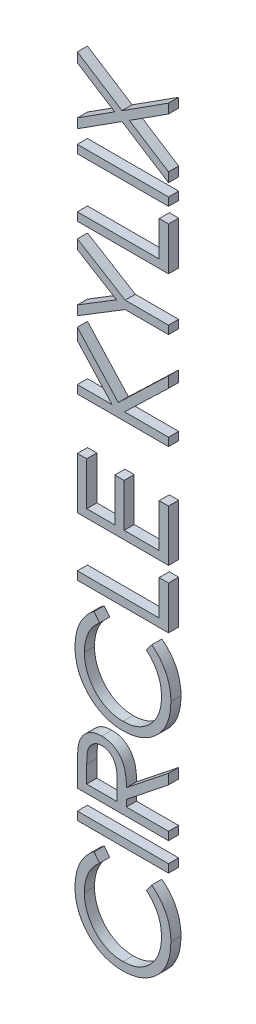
from build123d import *

# Parameters (mm, degrees)
ESTRUSIONE_ESTRUSIONE1_DEPTH    = 10
SCHIZZO2_W                      = 90
SCHIZZO2_H                      = 8.076923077
ESTRUSIONE_ESTRUSIONE1_2_DEPTH  = 10
ESTRUSIONE_ESTRUSIONE1_3_DEPTH  = 10
ESTRUSIONE_ESTRUSIONE1_4_DEPTH  = 10
ESTRUSIONE_ESTRUSIONE1_5_DEPTH  = 10
ESTRUSIONE_ESTRUSIONE1_6_DEPTH  = 10
ESTRUSIONE_ESTRUSIONE1_7_DEPTH  = 10
ESTRUSIONE_ESTRUSIONE1_8_DEPTH  = 10
ESTRUSIONE_ESTRUSIONE1_9_DEPTH  = 10
ESTRUSIONE_ESTRUSIONE1_10_DEPTH = 10
ESTRUSIONE_ESTRUSIONE1_11_DEPTH = 10


with BuildPart() as part:
    # Schizzo2 → Estrusione-Estrusione1 (new body)
    with BuildSketch(Plane.XY):
        with BuildLine():
            Line((121.514423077, 94.615384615), (126.923076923, 87.548076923))
            add(Edge.make_bspline(
                [(126.923076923, 87.548076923), (126.322245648, 87.043920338), (125.128683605, 86.042404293), (123.452521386, 84.431243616), (121.882708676, 82.751774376), (120.409159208, 81.006333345), (119.091097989, 79.154526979), (117.82587331, 77.266914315), (116.718125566, 75.274910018), (115.364873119, 72.53433639), (113.983544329, 68.935219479), (112.795482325, 64.420180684), (112.046317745, 59.700431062), (111.96462775, 56.481187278), (111.923076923, 54.84375)],
                knots=[0, 0, 0, 0, 0.75789156, 1.505565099, 2.245254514, 2.979266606, 3.711207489, 4.440978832, 5.174393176, 5.91211879, 7.394186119, 8.890401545, 10.418332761, 12, 12, 12, 12], degree=3))
            add(Edge.make_bspline(
                [(111.923076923, 54.84375), (111.93346453, 53.941608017), (111.954143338, 52.145696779), (112.226949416, 49.480450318), (112.610380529, 46.864971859), (113.179317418, 44.300962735), (113.898613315, 41.791686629), (114.758124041, 39.320739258), (115.821533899, 36.923894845), (116.996890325, 34.567998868), (118.324448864, 32.31081333), (119.772522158, 30.175133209), (121.324813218, 28.16862281), (122.987480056, 26.29015247), (124.751784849, 24.536116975), (126.637493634, 22.928588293), (128.6244476, 21.446088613), (130.714296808, 20.097066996), (132.887577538, 18.882634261), (135.156697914, 17.861485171), (137.482806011, 16.969620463), (139.882392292, 16.252792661), (142.339507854, 15.68981863), (144.864331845, 15.300604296), (147.452077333, 15.030959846), (149.206028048, 15.010375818), (150.090144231, 15)],
                knots=[0, 0, 0, 0, 1.054877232, 2.099964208, 3.13098259, 4.145888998, 5.169474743, 6.183358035, 7.203388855, 8.234598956, 9.261847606, 10.264062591, 11.251197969, 12.227332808, 13.196685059, 14.158975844, 15.123498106, 16.094582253, 17.066912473, 18.032714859, 19.002806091, 19.979168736, 20.95977404, 21.949109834, 22.966205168, 24, 24, 24, 24], degree=3))
            add(Edge.make_bspline(
                [(150.090144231, 15), (151.420348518, 15.032522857), (154.032028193, 15.096377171), (157.857979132, 15.662254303), (161.526761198, 16.529067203), (165.013533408, 17.806913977), (168.347362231, 19.414009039), (171.487818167, 21.419220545), (174.480909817, 23.750396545), (177.254146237, 26.431451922), (179.787320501, 29.373393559), (182.018059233, 32.529747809), (183.87758227, 35.892777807), (185.424964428, 39.425318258), (186.614422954, 43.154561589), (187.451786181, 47.073799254), (187.998013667, 51.174507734), (188.050308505, 53.976578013), (188.076923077, 55.402644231)],
                knots=[0, 0, 0, 0, 1.029159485, 2.020618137, 2.987588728, 3.942669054, 4.889339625, 5.846988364, 6.821327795, 7.821533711, 8.827683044, 9.822769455, 10.807800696, 11.797391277, 12.803701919, 13.832062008, 14.896664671, 16, 16, 16, 16], degree=3))
            add(Edge.make_bspline(
                [(188.076923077, 55.402644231), (188.033497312, 56.973856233), (187.948025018, 60.06637732), (187.223930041, 64.60155514), (186.049869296, 68.943046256), (184.406779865, 73.091084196), (182.270815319, 77.033975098), (179.681441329, 80.777889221), (176.614027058, 84.325986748), (174.271889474, 86.459534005), (173.076923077, 87.548076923)],
                knots=[0, 0, 0, 0, 1.028121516, 2.023589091, 2.998037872, 3.967518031, 4.937445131, 5.927275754, 6.942489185, 8, 8, 8, 8], degree=3))
            Line((173.076923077, 87.548076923), (178.431490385, 94.615384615))
            add(Edge.make_bspline(
                [(178.431490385, 94.615384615), (179.165310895, 94.046613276), (180.629436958, 92.911794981), (182.693943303, 91.074598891), (184.63406854, 89.137792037), (186.44012376, 87.096396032), (188.119584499, 84.946812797), (189.673363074, 82.68923958), (191.093213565, 80.325603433), (192.397415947, 77.874678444), (193.54572193, 75.330816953), (194.563288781, 72.716413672), (195.40572173, 70.015438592), (196.118325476, 67.250627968), (196.626444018, 64.397011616), (197.031069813, 61.487760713), (197.271123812, 58.495645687), (197.295393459, 56.478789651), (197.307692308, 55.456730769)],
                knots=[0, 0, 0, 0, 0.986911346, 1.969095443, 2.935967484, 3.900112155, 4.865124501, 5.834589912, 6.812044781, 7.795288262, 8.784678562, 9.777857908, 10.776141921, 11.791195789, 12.811324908, 13.855933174, 14.913475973, 16, 16, 16, 16], degree=3))
            add(Edge.make_bspline(
                [(197.307692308, 55.456730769), (197.300955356, 54.488750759), (197.287633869, 52.574690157), (197.071835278, 49.748722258), (196.777413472, 46.997561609), (196.334095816, 44.329071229), (195.810955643, 41.728689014), (195.109694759, 39.21998827), (194.324144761, 36.778282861), (193.400873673, 34.413382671), (192.359028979, 32.123276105), (191.18153175, 29.915349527), (189.878283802, 27.790618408), (188.478012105, 25.728193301), (186.935738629, 23.758541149), (185.272882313, 21.864593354), (183.495047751, 20.03572968), (182.213065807, 18.904232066), (181.568509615, 18.335336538)],
                knots=[0, 0, 0, 0, 1.114604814, 2.203992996, 3.262667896, 4.300477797, 5.318619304, 6.316056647, 7.298880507, 8.271930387, 9.238335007, 10.195173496, 11.151986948, 12.108099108, 13.064862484, 14.031167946, 15.010108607, 16, 16, 16, 16], degree=3))
            add(Edge.make_bspline(
                [(181.568509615, 18.335336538), (180.448855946, 17.42419371), (178.223066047, 15.612908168), (174.616052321, 13.294515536), (170.853377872, 11.316600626), (166.913248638, 9.699531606), (162.794132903, 8.457433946), (158.502657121, 7.584158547), (154.047400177, 7.020635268), (151.017354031, 6.955954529), (149.477163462, 6.923076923)],
                knots=[0, 0, 0, 0, 0.994611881, 1.977215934, 2.950189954, 3.921972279, 4.908960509, 5.911694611, 6.938501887, 8, 8, 8, 8], degree=3))
            add(Edge.make_bspline(
                [(149.477163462, 6.923076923), (147.858308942, 6.963067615), (144.673313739, 7.041746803), (139.999126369, 7.710210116), (135.520947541, 8.785550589), (131.247136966, 10.312899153), (127.155215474, 12.249322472), (123.276441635, 14.641435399), (119.586009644, 17.461447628), (116.139916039, 20.687242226), (112.988904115, 24.22468799), (110.21674459, 28.012886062), (107.90972275, 32.044421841), (105.981250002, 36.274880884), (104.498963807, 40.735941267), (103.461310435, 45.418085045), (102.81544173, 50.312514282), (102.733793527, 53.651833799), (102.692307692, 55.348557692)],
                knots=[0, 0, 0, 0, 1.032925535, 2.032216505, 3.007276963, 3.968222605, 4.92396291, 5.891752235, 6.871517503, 7.883894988, 8.900124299, 9.891468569, 10.874487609, 11.85992873, 12.854644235, 13.869047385, 14.917252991, 16, 16, 16, 16], degree=3))
            add(Edge.make_bspline(
                [(102.692307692, 55.348557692), (102.704716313, 56.382640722), (102.729277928, 58.429503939), (102.968422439, 61.457478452), (103.367918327, 64.405243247), (103.908809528, 67.275898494), (104.589952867, 70.07774346), (105.438875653, 72.805536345), (106.449577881, 75.45259748), (107.603752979, 78.018066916), (108.901616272, 80.484626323), (110.327859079, 82.850727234), (111.875274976, 85.106936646), (113.559705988, 87.241527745), (115.367179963, 89.257112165), (117.276524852, 91.183589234), (119.336735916, 92.964881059), (120.787198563, 94.064209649), (121.514423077, 94.615384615)],
                knots=[0, 0, 0, 0, 1.096622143, 2.170653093, 3.219033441, 4.250379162, 5.267604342, 6.275621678, 7.278284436, 8.271072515, 9.257558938, 10.232633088, 11.19973724, 12.157384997, 13.114417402, 14.069920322, 15.032307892, 16, 16, 16, 16], degree=3))
        make_face()
    extrude(amount=ESTRUSIONE_ESTRUSIONE1_DEPTH)


with BuildPart() as body_2:
    # Schizzo2 → Estrusione-Estrusione1 2 (new body)
    with BuildSketch(Plane.XY):
        with Locations((150, 117.115384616)):
            Rectangle(SCHIZZO2_W, SCHIZZO2_H)
    extrude(amount=ESTRUSIONE_ESTRUSIONE1_2_DEPTH)


with BuildPart() as body_3:
    # Schizzo2 → Estrusione-Estrusione1 3 (new body)
    with BuildSketch(Plane.XY):
        with BuildLine():
            Line((105, 140.769230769), (105, 158.780048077))
            add(Edge.make_bspline(
                [(105, 158.780048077), (105.004000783, 159.98196281), (105.011682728, 162.289772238), (105.054516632, 165.595942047), (105.177285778, 168.600067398), (105.282935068, 171.300577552), (105.475584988, 173.697422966), (105.659715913, 175.7979533), (105.900752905, 177.592494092), (106.124606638, 178.678815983), (106.225961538, 179.170673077)],
                knots=[0, 0, 0, 0, 1.410062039, 2.707475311, 3.878576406, 4.937260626, 5.877586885, 6.699081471, 7.410979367, 8, 8, 8, 8], degree=3))
            add(Edge.make_bspline(
                [(106.225961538, 179.170673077), (106.388650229, 179.829128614), (106.710557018, 181.131993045), (107.390940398, 183.007859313), (108.178325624, 184.795343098), (109.103021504, 186.487181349), (110.17240477, 188.074302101), (111.366110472, 189.575305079), (112.681727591, 190.985317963), (114.13111598, 192.285938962), (115.683394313, 193.467359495), (117.334302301, 194.503647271), (119.07701379, 195.379291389), (120.914243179, 196.066447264), (122.825695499, 196.643046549), (124.83088, 197.030450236), (126.923102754, 197.271764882), (128.346679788, 197.295604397), (129.068509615, 197.307692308)],
                knots=[0, 0, 0, 0, 1.02737844, 2.032840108, 3.019645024, 3.985760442, 4.950801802, 5.916702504, 6.889791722, 7.870143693, 8.864820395, 9.842884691, 10.820524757, 11.815201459, 12.812418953, 13.84314332, 14.906358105, 16, 16, 16, 16], degree=3))
            add(Edge.make_bspline(
                [(129.068509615, 197.307692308), (130.26769802, 197.269918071), (132.607625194, 197.19621075), (136.00347643, 196.508993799), (139.171201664, 195.383311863), (142.106812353, 193.832141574), (144.753086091, 191.856783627), (147.077412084, 189.48271757), (149.022438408, 186.708618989), (150.371224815, 184.126150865), (151.235042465, 181.844928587), (151.84283455, 179.966929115), (152.312427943, 177.918349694), (152.733117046, 175.718818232), (153.050732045, 173.359181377), (153.28335876, 170.84509465), (153.428748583, 168.174765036), (153.450400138, 166.340331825), (153.461538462, 165.396634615)],
                knots=[0, 0, 0, 0, 1.260483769, 2.459530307, 3.627416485, 4.787058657, 5.939039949, 7.08810263, 8.267026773, 9.491475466, 10.141966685, 10.831826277, 11.566392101, 12.351337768, 13.187381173, 14.07005841, 15.007169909, 16, 16, 16, 16], degree=3))
            Line((153.461538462, 165.396634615), (195, 198.461538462))
            Line((195, 198.461538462), (195, 188.473557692))
            Line((195, 188.473557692), (153.461538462, 155.408653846))
            Line((153.461538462, 155.408653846), (153.461538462, 148.846153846))
            Line((153.461538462, 148.846153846), (195, 148.846153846))
            Line((195, 148.846153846), (195, 140.769230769))
            Line((195, 140.769230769), (105, 140.769230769))
        make_face()
        with BuildLine():
            Line((114.230769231, 148.846153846), (144.230769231, 148.846153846))
            Line((144.230769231, 148.846153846), (144.356971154, 165.324519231))
            add(Edge.make_bspline(
                [(144.356971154, 165.324519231), (144.357311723, 166.093891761), (144.357971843, 167.585154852), (144.255272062, 169.742599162), (144.138452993, 171.751406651), (143.959725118, 173.603867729), (143.729526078, 175.300896), (143.44112336, 176.84136153), (143.106561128, 178.228697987), (142.583371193, 179.8414934), (141.790671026, 181.663720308), (140.559465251, 183.600786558), (139.080080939, 185.30040678), (137.339573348, 186.684621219), (135.45629109, 187.844367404), (133.410945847, 188.624830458), (131.269886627, 189.14497595), (129.798812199, 189.201841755), (129.050480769, 189.230769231)],
                knots=[0, 0, 0, 0, 1.146477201, 2.22219935, 3.21835465, 4.145220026, 4.995151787, 5.769831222, 6.480173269, 7.120302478, 8.295254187, 9.430763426, 10.528629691, 11.636497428, 12.733230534, 13.811001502, 14.886462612, 16, 16, 16, 16], degree=3))
            add(Edge.make_bspline(
                [(129.050480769, 189.230769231), (128.326770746, 189.199768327), (126.892641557, 189.138335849), (124.792052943, 188.639532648), (122.808902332, 187.786778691), (120.940629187, 186.66497708), (119.271224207, 185.257111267), (117.827347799, 183.638023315), (116.645336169, 181.808024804), (115.859728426, 180.112707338), (115.398375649, 178.58526022), (115.063049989, 177.26537074), (114.83032148, 175.766688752), (114.609885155, 174.0960298), (114.431435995, 172.250205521), (114.308344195, 170.22380598), (114.236256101, 168.029384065), (114.232640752, 166.508469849), (114.230769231, 165.721153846)],
                knots=[0, 0, 0, 0, 1.100823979, 2.181431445, 3.263702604, 4.376021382, 5.48638238, 6.575013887, 7.666064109, 8.791843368, 9.405226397, 10.093019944, 10.863016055, 11.711746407, 12.658404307, 13.684961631, 14.801597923, 16, 16, 16, 16], degree=3))
            Line((114.230769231, 165.721153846), (114.230769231, 148.846153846))
        make_face(mode=Mode.SUBTRACT)
    extrude(amount=ESTRUSIONE_ESTRUSIONE1_3_DEPTH)


with BuildPart() as body_4:
    # Schizzo2 → Estrusione-Estrusione1 4 (new body)
    with BuildSketch(Plane.XY):
        with BuildLine():
            Line((121.514423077, 300), (126.923076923, 292.932692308))
            add(Edge.make_bspline(
                [(126.923076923, 292.932692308), (126.322245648, 292.428535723), (125.128683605, 291.427019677), (123.452521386, 289.815859), (121.882708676, 288.136389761), (120.409159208, 286.390948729), (119.091097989, 284.539142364), (117.82587331, 282.651529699), (116.718125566, 280.659525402), (115.364873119, 277.918951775), (113.983544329, 274.319834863), (112.795482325, 269.804796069), (112.046317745, 265.085046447), (111.96462775, 261.865802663), (111.923076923, 260.228365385)],
                knots=[0, 0, 0, 0, 0.75789156, 1.505565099, 2.245254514, 2.979266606, 3.711207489, 4.440978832, 5.174393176, 5.91211879, 7.394186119, 8.890401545, 10.418332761, 12, 12, 12, 12], degree=3))
            add(Edge.make_bspline(
                [(111.923076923, 260.228365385), (111.93346453, 259.326223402), (111.954143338, 257.530312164), (112.226949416, 254.865065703), (112.610380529, 252.249587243), (113.179317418, 249.68557812), (113.898613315, 247.176302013), (114.758124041, 244.705354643), (115.821533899, 242.30851023), (116.996890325, 239.952614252), (118.324448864, 237.695428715), (119.772522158, 235.559748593), (121.324813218, 233.553238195), (122.987480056, 231.674767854), (124.751784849, 229.92073236), (126.637493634, 228.313203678), (128.6244476, 226.830703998), (130.714296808, 225.481682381), (132.887577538, 224.267249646), (135.156697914, 223.246100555), (137.482806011, 222.354235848), (139.882392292, 221.637408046), (142.339507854, 221.074434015), (144.864331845, 220.68521968), (147.452077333, 220.415575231), (149.206028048, 220.394991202), (150.090144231, 220.384615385)],
                knots=[0, 0, 0, 0, 1.054877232, 2.099964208, 3.13098259, 4.145888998, 5.169474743, 6.183358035, 7.203388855, 8.234598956, 9.261847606, 10.264062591, 11.251197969, 12.227332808, 13.196685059, 14.158975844, 15.123498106, 16.094582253, 17.066912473, 18.032714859, 19.002806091, 19.979168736, 20.95977404, 21.949109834, 22.966205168, 24, 24, 24, 24], degree=3))
            add(Edge.make_bspline(
                [(150.090144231, 220.384615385), (151.420348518, 220.417138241), (154.032028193, 220.480992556), (157.857979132, 221.046869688), (161.526761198, 221.913682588), (165.013533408, 223.191529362), (168.347362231, 224.798624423), (171.487818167, 226.80383593), (174.480909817, 229.13501193), (177.254146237, 231.816067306), (179.787320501, 234.758008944), (182.018059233, 237.914363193), (183.87758227, 241.277393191), (185.424964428, 244.809933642), (186.614422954, 248.539176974), (187.451786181, 252.458414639), (187.998013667, 256.559123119), (188.050308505, 259.361193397), (188.076923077, 260.787259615)],
                knots=[0, 0, 0, 0, 1.029159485, 2.020618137, 2.987588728, 3.942669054, 4.889339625, 5.846988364, 6.821327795, 7.821533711, 8.827683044, 9.822769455, 10.807800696, 11.797391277, 12.803701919, 13.832062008, 14.896664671, 16, 16, 16, 16], degree=3))
            add(Edge.make_bspline(
                [(188.076923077, 260.787259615), (188.033497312, 262.358471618), (187.948025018, 265.450992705), (187.223930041, 269.986170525), (186.049869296, 274.327661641), (184.406779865, 278.475699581), (182.270815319, 282.418590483), (179.681441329, 286.162504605), (176.614027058, 289.710602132), (174.271889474, 291.84414939), (173.076923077, 292.932692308)],
                knots=[0, 0, 0, 0, 1.028121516, 2.023589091, 2.998037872, 3.967518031, 4.937445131, 5.927275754, 6.942489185, 8, 8, 8, 8], degree=3))
            Line((173.076923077, 292.932692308), (178.431490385, 300))
            add(Edge.make_bspline(
                [(178.431490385, 300), (179.165310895, 299.431228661), (180.629436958, 298.296410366), (182.693943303, 296.459214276), (184.63406854, 294.522407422), (186.44012376, 292.481011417), (188.119584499, 290.331428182), (189.673363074, 288.073854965), (191.093213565, 285.710218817), (192.397415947, 283.259293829), (193.54572193, 280.715432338), (194.563288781, 278.101029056), (195.40572173, 275.400053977), (196.118325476, 272.635243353), (196.626444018, 269.781627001), (197.031069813, 266.872376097), (197.271123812, 263.880261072), (197.295393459, 261.863405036), (197.307692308, 260.841346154)],
                knots=[0, 0, 0, 0, 0.986911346, 1.969095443, 2.935967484, 3.900112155, 4.865124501, 5.834589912, 6.812044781, 7.795288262, 8.784678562, 9.777857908, 10.776141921, 11.791195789, 12.811324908, 13.855933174, 14.913475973, 16, 16, 16, 16], degree=3))
            add(Edge.make_bspline(
                [(197.307692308, 260.841346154), (197.300955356, 259.873366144), (197.287633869, 257.959305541), (197.071835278, 255.133337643), (196.777413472, 252.382176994), (196.334095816, 249.713686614), (195.810955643, 247.113304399), (195.109694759, 244.604603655), (194.324144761, 242.162898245), (193.400873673, 239.797998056), (192.359028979, 237.50789149), (191.18153175, 235.299964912), (189.878283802, 233.175233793), (188.478012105, 231.112808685), (186.935738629, 229.143156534), (185.272882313, 227.249208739), (183.495047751, 225.420345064), (182.213065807, 224.28884745), (181.568509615, 223.719951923)],
                knots=[0, 0, 0, 0, 1.114604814, 2.203992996, 3.262667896, 4.300477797, 5.318619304, 6.316056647, 7.298880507, 8.271930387, 9.238335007, 10.195173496, 11.151986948, 12.108099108, 13.064862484, 14.031167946, 15.010108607, 16, 16, 16, 16], degree=3))
            add(Edge.make_bspline(
                [(181.568509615, 223.719951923), (180.448855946, 222.808809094), (178.223066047, 220.997523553), (174.616052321, 218.679130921), (170.853377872, 216.70121601), (166.913248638, 215.08414699), (162.794132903, 213.842049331), (158.502657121, 212.968773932), (154.047400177, 212.405250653), (151.017354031, 212.340569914), (149.477163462, 212.307692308)],
                knots=[0, 0, 0, 0, 0.994611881, 1.977215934, 2.950189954, 3.921972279, 4.908960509, 5.911694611, 6.938501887, 8, 8, 8, 8], degree=3))
            add(Edge.make_bspline(
                [(149.477163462, 212.307692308), (147.858308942, 212.347682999), (144.673313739, 212.426362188), (139.999126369, 213.0948255), (135.520947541, 214.170165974), (131.247136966, 215.697514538), (127.155215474, 217.633937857), (123.276441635, 220.026050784), (119.586009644, 222.846063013), (116.139916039, 226.07185761), (112.988904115, 229.609303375), (110.21674459, 233.397501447), (107.90972275, 237.429037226), (105.981250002, 241.659496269), (104.498963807, 246.120556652), (103.461310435, 250.80270043), (102.81544173, 255.697129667), (102.733793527, 259.036449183), (102.692307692, 260.733173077)],
                knots=[0, 0, 0, 0, 1.032925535, 2.032216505, 3.007276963, 3.968222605, 4.92396291, 5.891752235, 6.871517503, 7.883894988, 8.900124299, 9.891468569, 10.874487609, 11.85992873, 12.854644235, 13.869047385, 14.917252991, 16, 16, 16, 16], degree=3))
            add(Edge.make_bspline(
                [(102.692307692, 260.733173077), (102.704716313, 261.767256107), (102.729277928, 263.814119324), (102.968422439, 266.842093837), (103.367918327, 269.789858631), (103.908809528, 272.660513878), (104.589952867, 275.462358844), (105.438875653, 278.19015173), (106.449577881, 280.837212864), (107.603752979, 283.402682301), (108.901616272, 285.869241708), (110.327859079, 288.235342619), (111.875274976, 290.491552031), (113.559705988, 292.626143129), (115.367179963, 294.641727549), (117.276524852, 296.568204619), (119.336735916, 298.349496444), (120.787198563, 299.448825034), (121.514423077, 300)],
                knots=[0, 0, 0, 0, 1.096622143, 2.170653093, 3.219033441, 4.250379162, 5.267604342, 6.275621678, 7.278284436, 8.271072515, 9.257558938, 10.232633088, 11.19973724, 12.157384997, 13.114417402, 14.069920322, 15.032307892, 16, 16, 16, 16], degree=3))
        make_face()
    extrude(amount=ESTRUSIONE_ESTRUSIONE1_4_DEPTH)


with BuildPart() as body_5:
    # Schizzo2 → Estrusione-Estrusione1 5 (new body)
    with BuildSketch(Plane.XY):
        Polygon((105, 318.461538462), (105, 326.538461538), (185.769230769, 326.538461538), (185.769230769, 361.153846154), (195, 361.153846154), (195, 318.461538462), align=None)
    extrude(amount=ESTRUSIONE_ESTRUSIONE1_5_DEPTH)


with BuildPart() as body_6:
    # Schizzo2 → Estrusione-Estrusione1 6 (new body)
    with BuildSketch(Plane.XY):
        Polygon((105, 376.153846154), (105, 426.923076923), (114.230769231, 426.923076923), (114.230769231, 384.230769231), (141.923076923, 384.230769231), (141.923076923, 426.923076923), (151.153846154, 426.923076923), (151.153846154, 384.230769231), (185.769230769, 384.230769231), (185.769230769, 426.923076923), (195, 426.923076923), (195, 376.153846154), align=None)
    extrude(amount=ESTRUSIONE_ESTRUSIONE1_6_DEPTH)


with BuildPart() as body_7:
    # Schizzo2 → Estrusione-Estrusione1 7 (new body)
    with BuildSketch(Plane.XY):
        Polygon((105, 477.692307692), (105, 485.769230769), (139.272836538, 485.769230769), (105, 523.287259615), (105, 534.807692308), (145.384615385, 490.582932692), (195, 538.269230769), (195, 527.506009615), (151.568509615, 485.769230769), (195, 485.769230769), (195, 477.692307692), align=None)
    extrude(amount=ESTRUSIONE_ESTRUSIONE1_7_DEPTH)


with BuildPart() as body_8:
    # Schizzo2 → Estrusione-Estrusione1 8 (new body)
    with BuildSketch(Plane.XY):
        Polygon((105, 544.615384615), (105, 553.864182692), (143.671875, 577.518028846), (105, 601.135817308), (105, 610.384615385), (152.217548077, 581.538461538), (195, 581.538461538), (195, 573.461538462), (152.217548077, 573.461538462), align=None)
    extrude(amount=ESTRUSIONE_ESTRUSIONE1_8_DEPTH)


with BuildPart() as body_9:
    # Schizzo2 → Estrusione-Estrusione1 9 (new body)
    with BuildSketch(Plane.XY):
        Polygon((105, 625.384615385), (105, 633.461538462), (185.769230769, 633.461538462), (185.769230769, 668.076923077), (195, 668.076923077), (195, 625.384615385), align=None)
    extrude(amount=ESTRUSIONE_ESTRUSIONE1_9_DEPTH)


with BuildPart() as body_10:
    # Schizzo2 → Estrusione-Estrusione1 10 (new body)
    with BuildSketch(Plane.XY):
        with Locations((150, 687.115384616)):
            Rectangle(SCHIZZO2_W, SCHIZZO2_H)
    extrude(amount=ESTRUSIONE_ESTRUSIONE1_10_DEPTH)


with BuildPart() as body_11:
    # Schizzo2 → Estrusione-Estrusione1 11 (new body)
    with BuildSketch(Plane.XY):
        Polygon((105, 704.423076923), (105, 713.743990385), (141.814903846, 737.307692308), (105, 760.871394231), (105, 770.192307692), (149.098557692, 741.977163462), (195, 771.346153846), (195, 762.025240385), (156.382211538, 737.307692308), (195, 712.590144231), (195, 703.269230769), (149.098557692, 732.65625), align=None)
    extrude(amount=ESTRUSIONE_ESTRUSIONE1_11_DEPTH)


solid = Compound([part.part, body_2.part, body_3.part, body_4.part, body_5.part, body_6.part, body_7.part, body_8.part, body_9.part, body_10.part, body_11.part])
